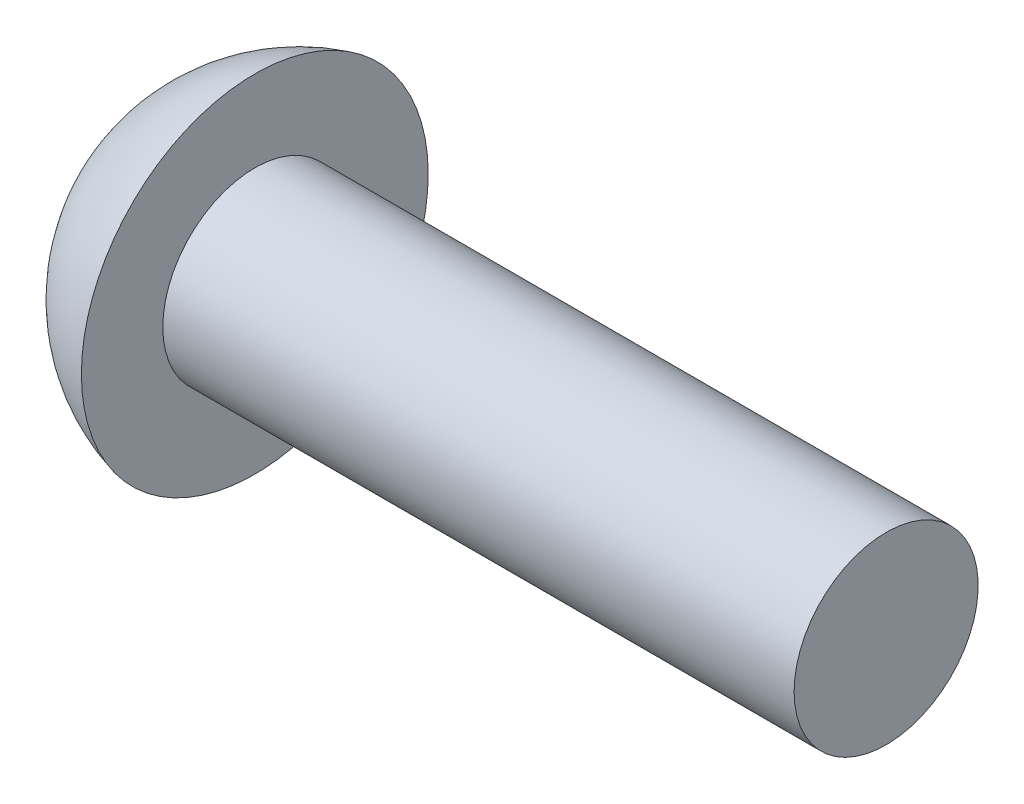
ISO-10303-21;
HEADER;
FILE_DESCRIPTION(('STEP AP214'),'2;1');
FILE_NAME('part.step','',(''),(''),'','','');
FILE_SCHEMA(('AUTOMOTIVE_DESIGN { 1 0 10303 214 1 1 1 1 }'));
ENDSEC;
DATA;
#1=APPLICATION_CONTEXT('core data for automotive mechanical design processes');
#2=APPLICATION_PROTOCOL_DEFINITION('international standard','automotive_design',2000,#1);
#3=PRODUCT_CONTEXT('',#1,'mechanical');
#4=PRODUCT('Part','Part','',(#3));
#5=PRODUCT_RELATED_PRODUCT_CATEGORY('part','',(#4));
#6=PRODUCT_DEFINITION_FORMATION('','',#4);
#7=PRODUCT_DEFINITION_CONTEXT('part definition',#1,'design');
#8=PRODUCT_DEFINITION('design','',#6,#7);
#9=PRODUCT_DEFINITION_SHAPE('','',#8);
#10=(LENGTH_UNIT() NAMED_UNIT(*) SI_UNIT(.MILLI.,.METRE.));
#11=(NAMED_UNIT(*) PLANE_ANGLE_UNIT() SI_UNIT($,.RADIAN.));
#12=(NAMED_UNIT(*) SI_UNIT($,.STERADIAN.) SOLID_ANGLE_UNIT());
#13=UNCERTAINTY_MEASURE_WITH_UNIT(LENGTH_MEASURE(1.E-05),#10,'distance_accuracy_value','');
#14=(GEOMETRIC_REPRESENTATION_CONTEXT(3) GLOBAL_UNCERTAINTY_ASSIGNED_CONTEXT((#13)) GLOBAL_UNIT_ASSIGNED_CONTEXT((#10,
#11,#12)) REPRESENTATION_CONTEXT('',''));
#15=CARTESIAN_POINT('',(0.,0.,0.));
#16=DIRECTION('',(0.,0.,1.));
#17=DIRECTION('',(1.,0.,0.));
#18=AXIS2_PLACEMENT_3D('',#15,#16,#17);
#19=CARTESIAN_POINT('',(4.05026812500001,0.,0.));
#20=DIRECTION('',(-1.,0.,0.));
#21=DIRECTION('',(0.,1.,0.));
#22=AXIS2_PLACEMENT_3D('',#19,#20,#21);
#23=SPHERICAL_SURFACE('',#22,4.05026812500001);
#24=CARTESIAN_POINT('',(3.048,0.,0.));
#25=DIRECTION('',(-1.,0.,0.));
#26=DIRECTION('',(0.,0.,1.));
#27=AXIS2_PLACEMENT_3D('',#24,#25,#26);
#28=CIRCLE('',#27,3.9243);
#29=CARTESIAN_POINT('',(3.048,0.,3.9243));
#30=VERTEX_POINT('',#29);
#31=EDGE_CURVE('E151',#30,#30,#28,.T.);
#32=ORIENTED_EDGE('',*,*,#31,.T.);
#33=EDGE_LOOP('',(#32));
#34=FACE_BOUND('',#33,.T.);
#35=CARTESIAN_POINT('',(4.06332558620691,0.,0.156689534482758));
#36=DIRECTION('',(-0.0830454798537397,0.,-0.99654575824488));
#37=DIRECTION('',(-0.99654575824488,0.,0.0830454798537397));
#38=AXIS2_PLACEMENT_3D('',#35,#36,#37);
#39=CIRCLE('',#38,4.04721506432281);
#40=CARTESIAN_POINT('',(0.605375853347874,2.08314565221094,0.44485201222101));
#41=VERTEX_POINT('',#40);
#42=CARTESIAN_POINT('',(0.0597981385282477,0.490316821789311,0.490316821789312));
#43=VERTEX_POINT('',#42);
#44=EDGE_CURVE('E122',#41,#43,#39,.F.);
#45=ORIENTED_EDGE('',*,*,#44,.T.);
#46=CARTESIAN_POINT('',(4.06332558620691,0.156689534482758,0.));
#47=DIRECTION('',(-0.0830454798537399,-0.99654575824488,0.));
#48=DIRECTION('',(0.99654575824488,-0.0830454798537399,0.));
#49=AXIS2_PLACEMENT_3D('',#46,#47,#48);
#50=CIRCLE('',#49,4.04721506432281);
#51=CARTESIAN_POINT('',(0.60537585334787,0.444852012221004,2.08314565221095));
#52=VERTEX_POINT('',#51);
#53=EDGE_CURVE('E104',#43,#52,#50,.F.);
#54=ORIENTED_EDGE('',*,*,#53,.T.);
#55=CARTESIAN_POINT('',(3.76509455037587,0.,-0.367661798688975));
#56=DIRECTION('',(0.612888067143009,0.,0.790169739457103));
#57=DIRECTION('',(0.790169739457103,0.,-0.612888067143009));
#58=AXIS2_PLACEMENT_3D('',#55,#56,#57);
#59=CIRCLE('',#58,4.02345283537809);
#60=CARTESIAN_POINT('',(0.605375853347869,-0.444852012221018,2.08314565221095));
#61=VERTEX_POINT('',#60);
#62=EDGE_CURVE('E115',#61,#52,#59,.F.);
#63=ORIENTED_EDGE('',*,*,#62,.F.);
#64=CARTESIAN_POINT('',(4.06332558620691,-0.156689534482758,0.));
#65=DIRECTION('',(-0.0830454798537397,0.99654575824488,0.));
#66=DIRECTION('',(-0.99654575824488,-0.0830454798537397,0.));
#67=AXIS2_PLACEMENT_3D('',#64,#65,#66);
#68=CIRCLE('',#67,4.04721506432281);
#69=CARTESIAN_POINT('',(0.059798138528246,-0.490316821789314,0.490316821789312));
#70=VERTEX_POINT('',#69);
#71=EDGE_CURVE('E181',#61,#70,#68,.F.);
#72=ORIENTED_EDGE('',*,*,#71,.T.);
#73=CARTESIAN_POINT('',(0.605375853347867,-2.08314565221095,0.44485201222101));
#74=VERTEX_POINT('',#73);
#75=EDGE_CURVE('E156',#70,#74,#39,.F.);
#76=ORIENTED_EDGE('',*,*,#75,.T.);
#77=CARTESIAN_POINT('',(3.76509455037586,0.367661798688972,0.));
#78=DIRECTION('',(0.612888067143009,-0.790169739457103,0.));
#79=DIRECTION('',(0.790169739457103,0.612888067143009,0.));
#80=AXIS2_PLACEMENT_3D('',#77,#78,#79);
#81=CIRCLE('',#80,4.02345283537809);
#82=CARTESIAN_POINT('',(0.605375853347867,-2.08314565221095,-0.444852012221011));
#83=VERTEX_POINT('',#82);
#84=EDGE_CURVE('E154',#83,#74,#81,.F.);
#85=ORIENTED_EDGE('',*,*,#84,.F.);
#86=CARTESIAN_POINT('',(4.06332558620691,0.,-0.156689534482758));
#87=DIRECTION('',(-0.0830454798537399,0.,0.99654575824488));
#88=DIRECTION('',(0.99654575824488,0.,0.0830454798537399));
#89=AXIS2_PLACEMENT_3D('',#86,#87,#88);
#90=CIRCLE('',#89,4.04721506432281);
#91=CARTESIAN_POINT('',(0.059798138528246,-0.49031682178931,-0.490316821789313));
#92=VERTEX_POINT('',#91);
#93=EDGE_CURVE('E158',#83,#92,#90,.F.);
#94=ORIENTED_EDGE('',*,*,#93,.T.);
#95=CARTESIAN_POINT('',(0.605375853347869,-0.444852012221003,-2.08314565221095));
#96=VERTEX_POINT('',#95);
#97=EDGE_CURVE('E185',#92,#96,#68,.F.);
#98=ORIENTED_EDGE('',*,*,#97,.T.);
#99=CARTESIAN_POINT('',(3.76509455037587,0.,0.367661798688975));
#100=DIRECTION('',(0.612888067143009,0.,-0.790169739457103));
#101=DIRECTION('',(-0.790169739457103,0.,-0.612888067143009));
#102=AXIS2_PLACEMENT_3D('',#99,#100,#101);
#103=CIRCLE('',#102,4.02345283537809);
#104=CARTESIAN_POINT('',(0.605375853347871,0.444852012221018,-2.08314565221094));
#105=VERTEX_POINT('',#104);
#106=EDGE_CURVE('E116',#105,#96,#103,.F.);
#107=ORIENTED_EDGE('',*,*,#106,.F.);
#108=CARTESIAN_POINT('',(0.0597981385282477,0.490316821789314,-0.490316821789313));
#109=VERTEX_POINT('',#108);
#110=EDGE_CURVE('E141',#105,#109,#50,.F.);
#111=ORIENTED_EDGE('',*,*,#110,.T.);
#112=CARTESIAN_POINT('',(0.605375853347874,2.08314565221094,-0.44485201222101));
#113=VERTEX_POINT('',#112);
#114=EDGE_CURVE('E55',#109,#113,#90,.F.);
#115=ORIENTED_EDGE('',*,*,#114,.T.);
#116=CARTESIAN_POINT('',(3.76509455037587,-0.367661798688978,0.));
#117=DIRECTION('',(0.612888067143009,0.790169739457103,0.));
#118=DIRECTION('',(-0.790169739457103,0.612888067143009,0.));
#119=AXIS2_PLACEMENT_3D('',#116,#117,#118);
#120=CIRCLE('',#119,4.02345283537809);
#121=EDGE_CURVE('E40',#41,#113,#120,.F.);
#122=ORIENTED_EDGE('',*,*,#121,.F.);
#123=EDGE_LOOP('',(#45,#54,#63,#72,#76,#85,#94,#98,#107,#111,#115,#122));
#124=FACE_BOUND('',#123,.T.);
#125=ADVANCED_FACE('F33',(#34,#124),#23,.T.);
#126=CARTESIAN_POINT('',(3.29108429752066,0.,-0.221042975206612));
#127=DIRECTION('',(-0.0830454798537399,0.,0.99654575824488));
#128=DIRECTION('',(0.99654575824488,0.,0.0830454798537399));
#129=AXIS2_PLACEMENT_3D('',#126,#127,#128);
#130=PLANE('',#129);
#131=ORIENTED_EDGE('',*,*,#114,.F.);
#132=DIRECTION('',(0.993127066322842,-0.0827605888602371,0.0827605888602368));
#133=VECTOR('',#132,1.);
#134=CARTESIAN_POINT('',(3.30925221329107,0.219528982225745,-0.219528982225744));
#135=LINE('',#134,#133);
#136=CARTESIAN_POINT('',(2.9718,0.247650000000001,-0.247649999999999));
#137=VERTEX_POINT('',#136);
#138=EDGE_CURVE('E163',#109,#137,#135,.T.);
#139=ORIENTED_EDGE('',*,*,#138,.T.);
#140=DIRECTION('',(0.788462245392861,-0.611563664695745,0.0657051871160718));
#141=VECTOR('',#140,1.);
#142=CARTESIAN_POINT('',(0.,2.5527,-0.4953));
#143=LINE('',#142,#141);
#144=EDGE_CURVE('E125',#113,#137,#143,.T.);
#145=ORIENTED_EDGE('',*,*,#144,.F.);
#146=EDGE_LOOP('',(#131,#139,#145));
#147=FACE_BOUND('',#146,.T.);
#148=ADVANCED_FACE('F162',(#147),#130,.T.);
#149=DIRECTION('',(0.788462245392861,0.611563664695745,0.0657051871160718));
#150=VECTOR('',#149,1.);
#151=CARTESIAN_POINT('',(0.,-2.5527,-0.4953));
#152=LINE('',#151,#150);
#153=CARTESIAN_POINT('',(2.9718,-0.24765,-0.24765));
#154=VERTEX_POINT('',#153);
#155=EDGE_CURVE('E47',#83,#154,#152,.T.);
#156=ORIENTED_EDGE('',*,*,#155,.T.);
#157=DIRECTION('',(-0.993127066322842,-0.0827605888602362,-0.0827605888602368));
#158=VECTOR('',#157,1.);
#159=CARTESIAN_POINT('',(3.30925221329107,-0.219528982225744,-0.219528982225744));
#160=LINE('',#159,#158);
#161=EDGE_CURVE('E183',#154,#92,#160,.T.);
#162=ORIENTED_EDGE('',*,*,#161,.T.);
#163=ORIENTED_EDGE('',*,*,#93,.F.);
#164=EDGE_LOOP('',(#156,#162,#163));
#165=FACE_BOUND('',#164,.T.);
#166=ADVANCED_FACE('F207',(#165),#130,.T.);
#167=CARTESIAN_POINT('',(3.29108429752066,0.,0.221042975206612));
#168=DIRECTION('',(-0.0830454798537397,0.,-0.99654575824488));
#169=DIRECTION('',(-0.99654575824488,0.,0.0830454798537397));
#170=AXIS2_PLACEMENT_3D('',#167,#168,#169);
#171=PLANE('',#170);
#172=DIRECTION('',(0.788462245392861,-0.611563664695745,-0.0657051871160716));
#173=VECTOR('',#172,1.);
#174=CARTESIAN_POINT('',(0.,2.5527,0.495299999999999));
#175=LINE('',#174,#173);
#176=CARTESIAN_POINT('',(2.9718,0.247649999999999,0.247650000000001));
#177=VERTEX_POINT('',#176);
#178=EDGE_CURVE('E120',#41,#177,#175,.T.);
#179=ORIENTED_EDGE('',*,*,#178,.T.);
#180=DIRECTION('',(-0.993127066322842,0.0827605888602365,0.0827605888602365));
#181=VECTOR('',#180,1.);
#182=CARTESIAN_POINT('',(3.30925221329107,0.219528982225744,0.219528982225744));
#183=LINE('',#182,#181);
#184=EDGE_CURVE('E11',#177,#43,#183,.T.);
#185=ORIENTED_EDGE('',*,*,#184,.T.);
#186=ORIENTED_EDGE('',*,*,#44,.F.);
#187=EDGE_LOOP('',(#179,#185,#186));
#188=FACE_BOUND('',#187,.T.);
#189=ADVANCED_FACE('F121',(#188),#171,.T.);
#190=ORIENTED_EDGE('',*,*,#75,.F.);
#191=DIRECTION('',(0.993127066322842,0.0827605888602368,-0.0827605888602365));
#192=VECTOR('',#191,1.);
#193=CARTESIAN_POINT('',(3.30925221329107,-0.219528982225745,0.219528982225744));
#194=LINE('',#193,#192);
#195=CARTESIAN_POINT('',(2.9718,-0.24765,0.24765));
#196=VERTEX_POINT('',#195);
#197=EDGE_CURVE('E178',#70,#196,#194,.T.);
#198=ORIENTED_EDGE('',*,*,#197,.T.);
#199=DIRECTION('',(0.788462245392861,0.611563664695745,-0.0657051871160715));
#200=VECTOR('',#199,1.);
#201=CARTESIAN_POINT('',(0.,-2.5527,0.495299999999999));
#202=LINE('',#201,#200);
#203=EDGE_CURVE('E169',#74,#196,#202,.T.);
#204=ORIENTED_EDGE('',*,*,#203,.F.);
#205=EDGE_LOOP('',(#190,#198,#204));
#206=FACE_BOUND('',#205,.T.);
#207=ADVANCED_FACE('F177',(#206),#171,.T.);
#208=CARTESIAN_POINT('',(3.048,2.08279999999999,0.));
#209=DIRECTION('',(-1.,0.,0.));
#210=DIRECTION('',(0.,0.,1.));
#211=AXIS2_PLACEMENT_3D('',#208,#209,#210);
#212=PLANE('',#211);
#213=ORIENTED_EDGE('',*,*,#31,.F.);
#214=EDGE_LOOP('',(#213));
#215=FACE_BOUND('',#214,.T.);
#216=CARTESIAN_POINT('',(3.048,0.,0.));
#217=DIRECTION('',(-1.,0.,0.));
#218=DIRECTION('',(0.,0.,1.));
#219=AXIS2_PLACEMENT_3D('',#216,#217,#218);
#220=CIRCLE('',#219,2.08279999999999);
#221=CARTESIAN_POINT('',(3.048,0.,2.08279999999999));
#222=VERTEX_POINT('',#221);
#223=EDGE_CURVE('E148',#222,#222,#220,.T.);
#224=ORIENTED_EDGE('',*,*,#223,.T.);
#225=EDGE_LOOP('',(#224));
#226=FACE_BOUND('',#225,.T.);
#227=ADVANCED_FACE('F227',(#215,#226),#212,.F.);
#228=CARTESIAN_POINT('',(0.,0.,0.));
#229=DIRECTION('',(-1.,0.,0.));
#230=DIRECTION('',(0.,0.,1.));
#231=AXIS2_PLACEMENT_3D('',#228,#229,#230);
#232=CYLINDRICAL_SURFACE('',#231,2.0828);
#233=ORIENTED_EDGE('',*,*,#223,.F.);
#234=EDGE_LOOP('',(#233));
#235=FACE_BOUND('',#234,.T.);
#236=CARTESIAN_POINT('',(17.3355,0.,0.));
#237=DIRECTION('',(-1.,0.,0.));
#238=DIRECTION('',(0.,0.,1.));
#239=AXIS2_PLACEMENT_3D('',#236,#237,#238);
#240=CIRCLE('',#239,2.0828);
#241=CARTESIAN_POINT('',(17.3355,0.,2.0828));
#242=VERTEX_POINT('',#241);
#243=EDGE_CURVE('E145',#242,#242,#240,.T.);
#244=ORIENTED_EDGE('',*,*,#243,.T.);
#245=EDGE_LOOP('',(#244));
#246=FACE_BOUND('',#245,.T.);
#247=ADVANCED_FACE('F230',(#235,#246),#232,.T.);
#248=CARTESIAN_POINT('',(17.3355,0.,0.));
#249=DIRECTION('',(-1.,0.,0.));
#250=DIRECTION('',(0.,0.,1.));
#251=AXIS2_PLACEMENT_3D('',#248,#249,#250);
#252=PLANE('',#251);
#253=ORIENTED_EDGE('',*,*,#243,.F.);
#254=EDGE_LOOP('',(#253));
#255=FACE_BOUND('',#254,.T.);
#256=ADVANCED_FACE('F235',(#255),#252,.F.);
#257=CARTESIAN_POINT('',(2.9718,0.24765,-0.24765));
#258=DIRECTION('',(-1.,0.,0.));
#259=DIRECTION('',(0.,0.,1.));
#260=AXIS2_PLACEMENT_3D('',#257,#258,#259);
#261=PLANE('',#260);
#262=DIRECTION('',(0.,1.,0.));
#263=VECTOR('',#262,1.);
#264=CARTESIAN_POINT('',(2.9718,-0.24765,-0.24765));
#265=LINE('',#264,#263);
#266=EDGE_CURVE('E138',#154,#137,#265,.T.);
#267=ORIENTED_EDGE('',*,*,#266,.F.);
#268=DIRECTION('',(0.,0.,1.));
#269=VECTOR('',#268,1.);
#270=CARTESIAN_POINT('',(2.9718,-0.24765,-0.24765));
#271=LINE('',#270,#269);
#272=EDGE_CURVE('E133',#154,#196,#271,.T.);
#273=ORIENTED_EDGE('',*,*,#272,.T.);
#274=DIRECTION('',(0.,-1.,0.));
#275=VECTOR('',#274,1.);
#276=CARTESIAN_POINT('',(2.9718,0.24765,0.24765));
#277=LINE('',#276,#275);
#278=EDGE_CURVE('E112',#177,#196,#277,.T.);
#279=ORIENTED_EDGE('',*,*,#278,.F.);
#280=DIRECTION('',(0.,0.,-1.));
#281=VECTOR('',#280,1.);
#282=CARTESIAN_POINT('',(2.9718,0.24765,0.24765));
#283=LINE('',#282,#281);
#284=EDGE_CURVE('E132',#177,#137,#283,.T.);
#285=ORIENTED_EDGE('',*,*,#284,.T.);
#286=EDGE_LOOP('',(#267,#273,#279,#285));
#287=FACE_BOUND('',#286,.T.);
#288=ADVANCED_FACE('F131',(#287),#261,.T.);
#289=CARTESIAN_POINT('',(2.9718,0.24765,0.24765));
#290=DIRECTION('',(0.612888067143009,0.790169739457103,0.));
#291=DIRECTION('',(-0.790169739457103,0.612888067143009,0.));
#292=AXIS2_PLACEMENT_3D('',#289,#290,#291);
#293=PLANE('',#292);
#294=ORIENTED_EDGE('',*,*,#121,.T.);
#295=ORIENTED_EDGE('',*,*,#144,.T.);
#296=ORIENTED_EDGE('',*,*,#284,.F.);
#297=ORIENTED_EDGE('',*,*,#178,.F.);
#298=EDGE_LOOP('',(#294,#295,#296,#297));
#299=FACE_BOUND('',#298,.T.);
#300=ADVANCED_FACE('F136',(#299),#293,.F.);
#301=CARTESIAN_POINT('',(2.9718,-0.24765,-0.24765));
#302=DIRECTION('',(0.612888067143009,-0.790169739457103,0.));
#303=DIRECTION('',(0.790169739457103,0.612888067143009,0.));
#304=AXIS2_PLACEMENT_3D('',#301,#302,#303);
#305=PLANE('',#304);
#306=ORIENTED_EDGE('',*,*,#84,.T.);
#307=ORIENTED_EDGE('',*,*,#203,.T.);
#308=ORIENTED_EDGE('',*,*,#272,.F.);
#309=ORIENTED_EDGE('',*,*,#155,.F.);
#310=EDGE_LOOP('',(#306,#307,#308,#309));
#311=FACE_BOUND('',#310,.T.);
#312=ADVANCED_FACE('F172',(#311),#305,.F.);
#313=CARTESIAN_POINT('',(3.29108429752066,0.221042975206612,0.));
#314=DIRECTION('',(-0.0830454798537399,-0.99654575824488,0.));
#315=DIRECTION('',(0.99654575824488,-0.0830454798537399,0.));
#316=AXIS2_PLACEMENT_3D('',#313,#314,#315);
#317=PLANE('',#316);
#318=ORIENTED_EDGE('',*,*,#184,.F.);
#319=DIRECTION('',(0.788462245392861,-0.0657051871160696,-0.611563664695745));
#320=VECTOR('',#319,1.);
#321=CARTESIAN_POINT('',(0.,0.495299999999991,2.5527));
#322=LINE('',#321,#320);
#323=EDGE_CURVE('E102',#52,#177,#322,.T.);
#324=ORIENTED_EDGE('',*,*,#323,.F.);
#325=ORIENTED_EDGE('',*,*,#53,.F.);
#326=EDGE_LOOP('',(#318,#324,#325));
#327=FACE_BOUND('',#326,.T.);
#328=ADVANCED_FACE('F101',(#327),#317,.T.);
#329=CARTESIAN_POINT('',(3.29108429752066,-0.221042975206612,0.));
#330=DIRECTION('',(-0.0830454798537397,0.99654575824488,0.));
#331=DIRECTION('',(-0.99654575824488,-0.0830454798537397,0.));
#332=AXIS2_PLACEMENT_3D('',#329,#330,#331);
#333=PLANE('',#332);
#334=DIRECTION('',(0.788462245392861,0.0657051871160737,-0.611563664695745));
#335=VECTOR('',#334,1.);
#336=CARTESIAN_POINT('',(0.,-0.495300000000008,2.5527));
#337=LINE('',#336,#335);
#338=EDGE_CURVE('E117',#61,#196,#337,.T.);
#339=ORIENTED_EDGE('',*,*,#338,.T.);
#340=ORIENTED_EDGE('',*,*,#197,.F.);
#341=ORIENTED_EDGE('',*,*,#71,.F.);
#342=EDGE_LOOP('',(#339,#340,#341));
#343=FACE_BOUND('',#342,.T.);
#344=ADVANCED_FACE('F208',(#343),#333,.T.);
#345=CARTESIAN_POINT('',(2.9718,-0.247650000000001,0.247649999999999));
#346=DIRECTION('',(0.612888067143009,0.,0.790169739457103));
#347=DIRECTION('',(-0.790169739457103,0.,0.612888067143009));
#348=AXIS2_PLACEMENT_3D('',#345,#346,#347);
#349=PLANE('',#348);
#350=ORIENTED_EDGE('',*,*,#62,.T.);
#351=ORIENTED_EDGE('',*,*,#323,.T.);
#352=ORIENTED_EDGE('',*,*,#278,.T.);
#353=ORIENTED_EDGE('',*,*,#338,.F.);
#354=EDGE_LOOP('',(#350,#351,#352,#353));
#355=FACE_BOUND('',#354,.T.);
#356=ADVANCED_FACE('F109',(#355),#349,.F.);
#357=DIRECTION('',(0.788462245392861,-0.0657051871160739,0.611563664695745));
#358=VECTOR('',#357,1.);
#359=CARTESIAN_POINT('',(0.,0.495300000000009,-2.5527));
#360=LINE('',#359,#358);
#361=EDGE_CURVE('E196',#105,#137,#360,.T.);
#362=ORIENTED_EDGE('',*,*,#361,.T.);
#363=ORIENTED_EDGE('',*,*,#138,.F.);
#364=ORIENTED_EDGE('',*,*,#110,.F.);
#365=EDGE_LOOP('',(#362,#363,#364));
#366=FACE_BOUND('',#365,.T.);
#367=ADVANCED_FACE('F195',(#366),#317,.T.);
#368=ORIENTED_EDGE('',*,*,#161,.F.);
#369=DIRECTION('',(0.788462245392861,0.0657051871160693,0.611563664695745));
#370=VECTOR('',#369,1.);
#371=CARTESIAN_POINT('',(0.,-0.49529999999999,-2.5527));
#372=LINE('',#371,#370);
#373=EDGE_CURVE('E200',#96,#154,#372,.T.);
#374=ORIENTED_EDGE('',*,*,#373,.F.);
#375=ORIENTED_EDGE('',*,*,#97,.F.);
#376=EDGE_LOOP('',(#368,#374,#375));
#377=FACE_BOUND('',#376,.T.);
#378=ADVANCED_FACE('F205',(#377),#333,.T.);
#379=CARTESIAN_POINT('',(2.9718,0.247650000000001,-0.247649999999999));
#380=DIRECTION('',(0.612888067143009,0.,-0.790169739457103));
#381=DIRECTION('',(0.790169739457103,0.,0.612888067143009));
#382=AXIS2_PLACEMENT_3D('',#379,#380,#381);
#383=PLANE('',#382);
#384=ORIENTED_EDGE('',*,*,#106,.T.);
#385=ORIENTED_EDGE('',*,*,#373,.T.);
#386=ORIENTED_EDGE('',*,*,#266,.T.);
#387=ORIENTED_EDGE('',*,*,#361,.F.);
#388=EDGE_LOOP('',(#384,#385,#386,#387));
#389=FACE_BOUND('',#388,.T.);
#390=ADVANCED_FACE('F198',(#389),#383,.F.);
#391=CLOSED_SHELL('',(#125,#148,#166,#189,#207,#227,#247,#256,#288,#300,#312,#328,#344,#356,
#367,#378,#390));
#392=MANIFOLD_SOLID_BREP('B2',#391);
#393=ADVANCED_BREP_SHAPE_REPRESENTATION('',(#18,#392),#14);
#394=SHAPE_DEFINITION_REPRESENTATION(#9,#393);
ENDSEC;
END-ISO-10303-21;
